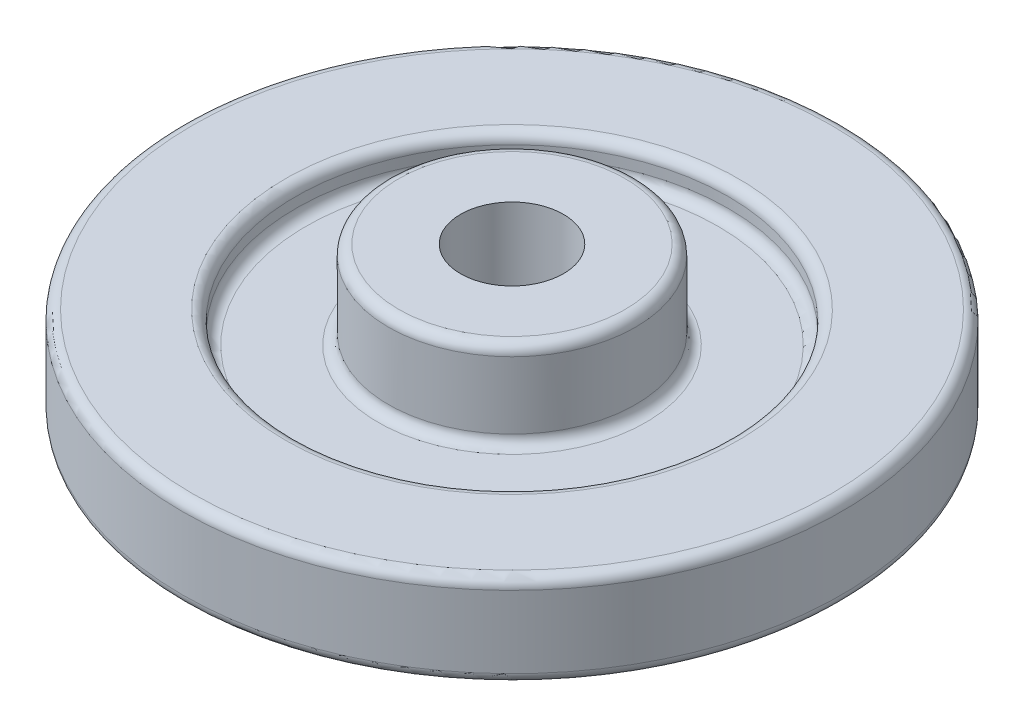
from build123d import *

# Parameters (mm, degrees)
SKETCH2_R      = 15.875
CENTER_H_DEPTH = 151.883202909
SKETCH3_W      = 28.575
SKETCH3_H      = 9.525
SKETCH4_W      = 23.8125
SKETCH4_H      = 9.525
FILLET_R_125_R = 3.175


with BuildPart() as part:
    # Sketch1 → wheel (revolve)
    with BuildSketch(Plane.XY, mode=Mode.PRIVATE) as wheel_sk:
        Polygon((0, 0), (101.6, 0), (101.6, 28.575), (38.1, 28.575), (38.1, 46.0502), (0, 46.0502), align=None)
    revolve(wheel_sk.sketch.rotate(Axis((0, 0, 0), (0, 1, 0)), 90), axis=Axis((0, 0, 0), (0, 1, 0)))

    # Sketch2 → center_h (cut, through all)
    with BuildSketch(Plane(origin=(0, 46.0502, 0), x_dir=(-1, 0, 0), z_dir=(0, 1, 0))):
        with Locations(Location((0, 0, 0), (0, 0, 90))):
            Circle(SKETCH2_R)
    extrude(amount=-CENTER_H_DEPTH, mode=Mode.SUBTRACT)

    # Sketch3 → upper_cut (revolve, cut)
    with BuildSketch(Plane.XY, mode=Mode.PRIVATE) as upper_cut_sk:
        with Locations((52.3875, 23.8125)):
            Rectangle(SKETCH3_W, SKETCH3_H)
    revolve(upper_cut_sk.sketch.rotate(Axis((0, 0, 0), (0, 1, 0)), 90), axis=Axis((0, 0, 0), (0, 1, 0)), mode=Mode.SUBTRACT)

    # Sketch4 → lower_cut (revolve, cut)
    with BuildSketch(Plane.XY, mode=Mode.PRIVATE) as lower_cut_sk:
        with Locations((50.00625, 4.7625)):
            Rectangle(SKETCH4_W, SKETCH4_H)
    revolve(lower_cut_sk.sketch.rotate(Axis((0, 0, 0), (0, 1, 0)), 90), axis=Axis((0, 0, 0), (0, 1, 0)), mode=Mode.SUBTRACT)

    # Fillet R.125
    fillet_r_125_edges = [part.edges().sort_by_distance(p)[0] for p in [
        (0, 19.05, 38.1),
        (0, 19.05, 66.675),
        (0, 28.575, 66.675),
        (0, 0, 61.9125),
        (0, 9.525, 61.9125),
        (0, 46.0502, 38.1),
        (0, 28.575, 101.6),
        (0, 0, 101.6),
    ]]
    fillet(fillet_r_125_edges, radius=FILLET_R_125_R)


solid = part.part
